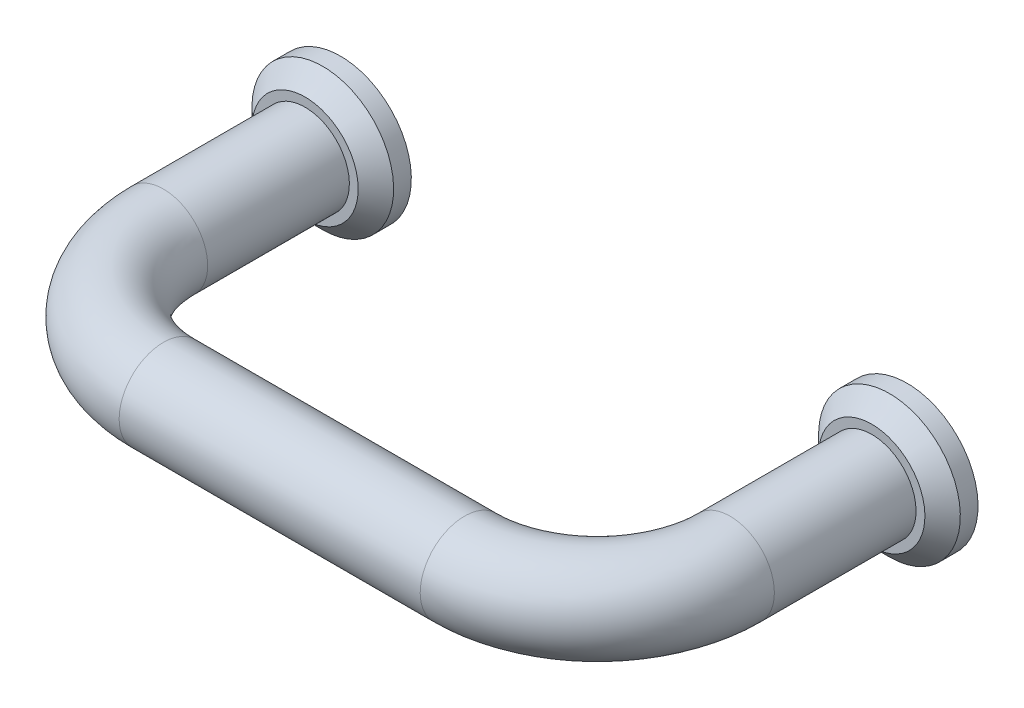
ISO-10303-21;
HEADER;
FILE_DESCRIPTION(('STEP AP214'),'2;1');
FILE_NAME('part.step','',(''),(''),'','','');
FILE_SCHEMA(('AUTOMOTIVE_DESIGN { 1 0 10303 214 1 1 1 1 }'));
ENDSEC;
DATA;
#1=APPLICATION_CONTEXT('core data for automotive mechanical design processes');
#2=APPLICATION_PROTOCOL_DEFINITION('international standard','automotive_design',2000,#1);
#3=PRODUCT_CONTEXT('',#1,'mechanical');
#4=PRODUCT('Part','Part','',(#3));
#5=PRODUCT_RELATED_PRODUCT_CATEGORY('part','',(#4));
#6=PRODUCT_DEFINITION_FORMATION('','',#4);
#7=PRODUCT_DEFINITION_CONTEXT('part definition',#1,'design');
#8=PRODUCT_DEFINITION('design','',#6,#7);
#9=PRODUCT_DEFINITION_SHAPE('','',#8);
#10=(LENGTH_UNIT() NAMED_UNIT(*) SI_UNIT(.MILLI.,.METRE.));
#11=(NAMED_UNIT(*) PLANE_ANGLE_UNIT() SI_UNIT($,.RADIAN.));
#12=(NAMED_UNIT(*) SI_UNIT($,.STERADIAN.) SOLID_ANGLE_UNIT());
#13=UNCERTAINTY_MEASURE_WITH_UNIT(LENGTH_MEASURE(1.E-05),#10,'distance_accuracy_value','');
#14=(GEOMETRIC_REPRESENTATION_CONTEXT(3) GLOBAL_UNCERTAINTY_ASSIGNED_CONTEXT((#13)) GLOBAL_UNIT_ASSIGNED_CONTEXT((#10,
#11,#12)) REPRESENTATION_CONTEXT('',''));
#15=CARTESIAN_POINT('',(0.,0.,0.));
#16=DIRECTION('',(0.,0.,1.));
#17=DIRECTION('',(1.,0.,0.));
#18=AXIS2_PLACEMENT_3D('',#15,#16,#17);
#19=CARTESIAN_POINT('',(0.,0.,0.));
#20=DIRECTION('',(0.,0.,-1.));
#21=DIRECTION('',(0.,1.,0.));
#22=AXIS2_PLACEMENT_3D('',#19,#20,#21);
#23=PLANE('',#22);
#24=CARTESIAN_POINT('',(0.,0.,0.));
#25=DIRECTION('',(0.,0.,1.));
#26=DIRECTION('',(0.,-1.,0.));
#27=AXIS2_PLACEMENT_3D('',#24,#25,#26);
#28=CIRCLE('',#27,4.);
#29=CARTESIAN_POINT('',(0.,-4.,0.));
#30=VERTEX_POINT('',#29);
#31=EDGE_CURVE('E56',#30,#30,#28,.T.);
#32=ORIENTED_EDGE('',*,*,#31,.F.);
#33=EDGE_LOOP('',(#32));
#34=FACE_BOUND('',#33,.T.);
#35=CARTESIAN_POINT('',(0.,0.,0.));
#36=DIRECTION('',(0.,0.,1.));
#37=DIRECTION('',(0.,-1.,0.));
#38=AXIS2_PLACEMENT_3D('',#35,#36,#37);
#39=CIRCLE('',#38,1.5);
#40=CARTESIAN_POINT('',(0.,-1.5,0.));
#41=VERTEX_POINT('',#40);
#42=EDGE_CURVE('E62',#41,#41,#39,.T.);
#43=ORIENTED_EDGE('',*,*,#42,.T.);
#44=EDGE_LOOP('',(#43));
#45=FACE_BOUND('',#44,.T.);
#46=ADVANCED_FACE('F12',(#34,#45),#23,.T.);
#47=CARTESIAN_POINT('',(0.,0.,10.));
#48=DIRECTION('',(0.,0.,-1.));
#49=DIRECTION('',(0.,-1.,0.));
#50=AXIS2_PLACEMENT_3D('',#47,#48,#49);
#51=CYLINDRICAL_SURFACE('',#50,2.5);
#52=CARTESIAN_POINT('',(0.,0.,10.));
#53=DIRECTION('',(0.,0.,-1.));
#54=DIRECTION('',(0.,1.,0.));
#55=AXIS2_PLACEMENT_3D('',#52,#53,#54);
#56=CIRCLE('',#55,2.5);
#57=CARTESIAN_POINT('',(-2.5,0.,10.));
#58=VERTEX_POINT('',#57);
#59=EDGE_CURVE('E20',#58,#58,#56,.T.);
#60=ORIENTED_EDGE('',*,*,#59,.T.);
#61=EDGE_LOOP('',(#60));
#62=FACE_BOUND('',#61,.T.);
#63=CARTESIAN_POINT('',(0.,0.,2.));
#64=DIRECTION('',(0.,0.,-1.));
#65=DIRECTION('',(0.,-1.,0.));
#66=AXIS2_PLACEMENT_3D('',#63,#64,#65);
#67=CIRCLE('',#66,2.5);
#68=CARTESIAN_POINT('',(0.,-2.5,2.));
#69=VERTEX_POINT('',#68);
#70=EDGE_CURVE('E16',#69,#69,#67,.F.);
#71=ORIENTED_EDGE('',*,*,#70,.T.);
#72=EDGE_LOOP('',(#71));
#73=FACE_BOUND('',#72,.T.);
#74=ADVANCED_FACE('F14',(#62,#73),#51,.T.);
#75=CARTESIAN_POINT('',(32.,0.,10.));
#76=DIRECTION('',(0.,0.,-1.));
#77=DIRECTION('',(0.,-1.,0.));
#78=AXIS2_PLACEMENT_3D('',#75,#76,#77);
#79=CYLINDRICAL_SURFACE('',#78,2.5);
#80=CARTESIAN_POINT('',(32.,0.,10.));
#81=DIRECTION('',(0.,0.,1.));
#82=DIRECTION('',(0.,1.,0.));
#83=AXIS2_PLACEMENT_3D('',#80,#81,#82);
#84=CIRCLE('',#83,2.5);
#85=CARTESIAN_POINT('',(34.5,0.,10.));
#86=VERTEX_POINT('',#85);
#87=EDGE_CURVE('E32',#86,#86,#84,.T.);
#88=ORIENTED_EDGE('',*,*,#87,.F.);
#89=EDGE_LOOP('',(#88));
#90=FACE_BOUND('',#89,.T.);
#91=CARTESIAN_POINT('',(32.,0.,2.));
#92=DIRECTION('',(0.,0.,-1.));
#93=DIRECTION('',(0.,-1.,0.));
#94=AXIS2_PLACEMENT_3D('',#91,#92,#93);
#95=CIRCLE('',#94,2.5);
#96=CARTESIAN_POINT('',(32.,-2.5,2.));
#97=VERTEX_POINT('',#96);
#98=EDGE_CURVE('E8',#97,#97,#95,.T.);
#99=ORIENTED_EDGE('',*,*,#98,.F.);
#100=EDGE_LOOP('',(#99));
#101=FACE_BOUND('',#100,.T.);
#102=ADVANCED_FACE('F91',(#90,#101),#79,.T.);
#103=CARTESIAN_POINT('',(7.5,0.,10.));
#104=DIRECTION('',(0.,-1.,0.));
#105=DIRECTION('',(1.,0.,0.));
#106=AXIS2_PLACEMENT_3D('',#103,#104,#105);
#107=TOROIDAL_SURFACE('',#106,7.5,2.5);
#108=CARTESIAN_POINT('',(7.5,0.,17.5));
#109=DIRECTION('',(-1.,0.,0.));
#110=DIRECTION('',(0.,1.,0.));
#111=AXIS2_PLACEMENT_3D('',#108,#109,#110);
#112=CIRCLE('',#111,2.5);
#113=CARTESIAN_POINT('',(7.5,0.,20.));
#114=VERTEX_POINT('',#113);
#115=EDGE_CURVE('E24',#114,#114,#112,.T.);
#116=CARTESIAN_POINT('',(7.5,0.,10.));
#117=DIRECTION('',(0.,-1.,0.));
#118=DIRECTION('',(1.,0.,0.));
#119=AXIS2_PLACEMENT_3D('',#116,#117,#118);
#120=CIRCLE('',#119,10.);
#121=EDGE_CURVE('',#114,#58,#120,.T.);
#122=ORIENTED_EDGE('',*,*,#115,.T.);
#123=ORIENTED_EDGE('',*,*,#59,.F.);
#124=ORIENTED_EDGE('',*,*,#121,.T.);
#125=ORIENTED_EDGE('',*,*,#121,.F.);
#126=EDGE_LOOP('',(#122,#124,#123,#125));
#127=FACE_BOUND('',#126,.T.);
#128=ADVANCED_FACE('F100',(#127),#107,.T.);
#129=CARTESIAN_POINT('',(24.5,0.,17.5));
#130=DIRECTION('',(-1.,0.,0.));
#131=DIRECTION('',(0.,-1.,0.));
#132=AXIS2_PLACEMENT_3D('',#129,#130,#131);
#133=CYLINDRICAL_SURFACE('',#132,2.5);
#134=CARTESIAN_POINT('',(24.5,0.,17.5));
#135=DIRECTION('',(-1.,0.,0.));
#136=DIRECTION('',(0.,1.,0.));
#137=AXIS2_PLACEMENT_3D('',#134,#135,#136);
#138=CIRCLE('',#137,2.5);
#139=CARTESIAN_POINT('',(24.5,0.,20.));
#140=VERTEX_POINT('',#139);
#141=EDGE_CURVE('E29',#140,#140,#138,.T.);
#142=ORIENTED_EDGE('',*,*,#141,.T.);
#143=EDGE_LOOP('',(#142));
#144=FACE_BOUND('',#143,.T.);
#145=ORIENTED_EDGE('',*,*,#115,.F.);
#146=EDGE_LOOP('',(#145));
#147=FACE_BOUND('',#146,.T.);
#148=ADVANCED_FACE('F106',(#144,#147),#133,.T.);
#149=CARTESIAN_POINT('',(24.5,0.,10.));
#150=DIRECTION('',(0.,-1.,0.));
#151=DIRECTION('',(1.,0.,0.));
#152=AXIS2_PLACEMENT_3D('',#149,#150,#151);
#153=TOROIDAL_SURFACE('',#152,7.5,2.5);
#154=CARTESIAN_POINT('',(24.5,0.,10.));
#155=DIRECTION('',(0.,-1.,0.));
#156=DIRECTION('',(1.,0.,0.));
#157=AXIS2_PLACEMENT_3D('',#154,#155,#156);
#158=CIRCLE('',#157,10.);
#159=EDGE_CURVE('',#86,#140,#158,.T.);
#160=ORIENTED_EDGE('',*,*,#87,.T.);
#161=ORIENTED_EDGE('',*,*,#141,.F.);
#162=ORIENTED_EDGE('',*,*,#159,.T.);
#163=ORIENTED_EDGE('',*,*,#159,.F.);
#164=EDGE_LOOP('',(#160,#162,#161,#163));
#165=FACE_BOUND('',#164,.T.);
#166=ADVANCED_FACE('F102',(#165),#153,.T.);
#167=CARTESIAN_POINT('',(32.,0.,2.));
#168=DIRECTION('',(0.,0.,-1.));
#169=DIRECTION('',(0.,-1.,0.));
#170=AXIS2_PLACEMENT_3D('',#167,#168,#169);
#171=PLANE('',#170);
#172=CARTESIAN_POINT('',(32.,0.,2.));
#173=DIRECTION('',(0.,0.,-1.));
#174=DIRECTION('',(0.,-1.,0.));
#175=AXIS2_PLACEMENT_3D('',#172,#173,#174);
#176=CIRCLE('',#175,3.);
#177=CARTESIAN_POINT('',(32.,-3.,2.));
#178=VERTEX_POINT('',#177);
#179=EDGE_CURVE('E35',#178,#178,#176,.T.);
#180=ORIENTED_EDGE('',*,*,#179,.F.);
#181=EDGE_LOOP('',(#180));
#182=FACE_BOUND('',#181,.T.);
#183=ORIENTED_EDGE('',*,*,#98,.T.);
#184=EDGE_LOOP('',(#183));
#185=FACE_BOUND('',#184,.T.);
#186=ADVANCED_FACE('F105',(#182,#185),#171,.F.);
#187=CARTESIAN_POINT('',(32.,0.,2.));
#188=DIRECTION('',(0.,0.,-1.));
#189=DIRECTION('',(0.,-1.,0.));
#190=AXIS2_PLACEMENT_3D('',#187,#188,#189);
#191=CONICAL_SURFACE('',#190,3.,0.785398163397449);
#192=CARTESIAN_POINT('',(32.,0.,1.));
#193=DIRECTION('',(0.,0.,-1.));
#194=DIRECTION('',(0.,-1.,0.));
#195=AXIS2_PLACEMENT_3D('',#192,#193,#194);
#196=CIRCLE('',#195,4.);
#197=CARTESIAN_POINT('',(32.,-4.,1.));
#198=VERTEX_POINT('',#197);
#199=EDGE_CURVE('E38',#198,#198,#196,.T.);
#200=ORIENTED_EDGE('',*,*,#199,.F.);
#201=EDGE_LOOP('',(#200));
#202=FACE_BOUND('',#201,.T.);
#203=ORIENTED_EDGE('',*,*,#179,.T.);
#204=EDGE_LOOP('',(#203));
#205=FACE_BOUND('',#204,.T.);
#206=ADVANCED_FACE('F146',(#202,#205),#191,.T.);
#207=CARTESIAN_POINT('',(32.,0.,0.));
#208=DIRECTION('',(0.,0.,-1.));
#209=DIRECTION('',(0.,-1.,0.));
#210=AXIS2_PLACEMENT_3D('',#207,#208,#209);
#211=CYLINDRICAL_SURFACE('',#210,4.);
#212=CARTESIAN_POINT('',(32.,0.,0.));
#213=DIRECTION('',(0.,0.,-1.));
#214=DIRECTION('',(0.,-1.,0.));
#215=AXIS2_PLACEMENT_3D('',#212,#213,#214);
#216=CIRCLE('',#215,4.);
#217=CARTESIAN_POINT('',(32.,-4.,0.));
#218=VERTEX_POINT('',#217);
#219=EDGE_CURVE('E41',#218,#218,#216,.T.);
#220=ORIENTED_EDGE('',*,*,#219,.F.);
#221=EDGE_LOOP('',(#220));
#222=FACE_BOUND('',#221,.T.);
#223=ORIENTED_EDGE('',*,*,#199,.T.);
#224=EDGE_LOOP('',(#223));
#225=FACE_BOUND('',#224,.T.);
#226=ADVANCED_FACE('F143',(#222,#225),#211,.T.);
#227=CARTESIAN_POINT('',(32.,0.,0.));
#228=DIRECTION('',(0.,0.,1.));
#229=DIRECTION('',(0.,1.,0.));
#230=AXIS2_PLACEMENT_3D('',#227,#228,#229);
#231=PLANE('',#230);
#232=CARTESIAN_POINT('',(32.,0.,0.));
#233=DIRECTION('',(0.,0.,-1.));
#234=DIRECTION('',(0.,-1.,0.));
#235=AXIS2_PLACEMENT_3D('',#232,#233,#234);
#236=CIRCLE('',#235,1.5);
#237=CARTESIAN_POINT('',(32.,-1.5,0.));
#238=VERTEX_POINT('',#237);
#239=EDGE_CURVE('E47',#238,#238,#236,.T.);
#240=ORIENTED_EDGE('',*,*,#239,.F.);
#241=EDGE_LOOP('',(#240));
#242=FACE_BOUND('',#241,.T.);
#243=ORIENTED_EDGE('',*,*,#219,.T.);
#244=EDGE_LOOP('',(#243));
#245=FACE_BOUND('',#244,.T.);
#246=ADVANCED_FACE('F96',(#242,#245),#231,.F.);
#247=CARTESIAN_POINT('',(32.,0.,7.));
#248=DIRECTION('',(0.,0.,-1.));
#249=DIRECTION('',(0.,-1.,0.));
#250=AXIS2_PLACEMENT_3D('',#247,#248,#249);
#251=CYLINDRICAL_SURFACE('',#250,1.5);
#252=CARTESIAN_POINT('',(32.,0.,7.));
#253=DIRECTION('',(0.,0.,-1.));
#254=DIRECTION('',(0.,-1.,0.));
#255=AXIS2_PLACEMENT_3D('',#252,#253,#254);
#256=CIRCLE('',#255,1.5);
#257=CARTESIAN_POINT('',(32.,-1.5,7.));
#258=VERTEX_POINT('',#257);
#259=EDGE_CURVE('E44',#258,#258,#256,.T.);
#260=ORIENTED_EDGE('',*,*,#259,.F.);
#261=EDGE_LOOP('',(#260));
#262=FACE_BOUND('',#261,.T.);
#263=ORIENTED_EDGE('',*,*,#239,.T.);
#264=EDGE_LOOP('',(#263));
#265=FACE_BOUND('',#264,.T.);
#266=ADVANCED_FACE('F127',(#262,#265),#251,.F.);
#267=CARTESIAN_POINT('',(32.,0.,7.));
#268=DIRECTION('',(0.,0.,-1.));
#269=DIRECTION('',(0.,-1.,0.));
#270=AXIS2_PLACEMENT_3D('',#267,#268,#269);
#271=PLANE('',#270);
#272=ORIENTED_EDGE('',*,*,#259,.T.);
#273=EDGE_LOOP('',(#272));
#274=FACE_BOUND('',#273,.T.);
#275=ADVANCED_FACE('F125',(#274),#271,.T.);
#276=CARTESIAN_POINT('',(0.,0.,2.));
#277=DIRECTION('',(0.,0.,-1.));
#278=DIRECTION('',(0.,-1.,0.));
#279=AXIS2_PLACEMENT_3D('',#276,#277,#278);
#280=PLANE('',#279);
#281=ORIENTED_EDGE('',*,*,#70,.F.);
#282=EDGE_LOOP('',(#281));
#283=FACE_BOUND('',#282,.T.);
#284=CARTESIAN_POINT('',(0.,0.,2.));
#285=DIRECTION('',(0.,0.,1.));
#286=DIRECTION('',(0.,-1.,0.));
#287=AXIS2_PLACEMENT_3D('',#284,#285,#286);
#288=CIRCLE('',#287,3.);
#289=CARTESIAN_POINT('',(0.,-3.,2.));
#290=VERTEX_POINT('',#289);
#291=EDGE_CURVE('E50',#290,#290,#288,.T.);
#292=ORIENTED_EDGE('',*,*,#291,.T.);
#293=EDGE_LOOP('',(#292));
#294=FACE_BOUND('',#293,.T.);
#295=ADVANCED_FACE('F122',(#283,#294),#280,.F.);
#296=CARTESIAN_POINT('',(0.,0.,2.));
#297=DIRECTION('',(0.,0.,-1.));
#298=DIRECTION('',(0.,-1.,0.));
#299=AXIS2_PLACEMENT_3D('',#296,#297,#298);
#300=CONICAL_SURFACE('',#299,3.,0.785398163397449);
#301=CARTESIAN_POINT('',(0.,0.,1.));
#302=DIRECTION('',(0.,0.,1.));
#303=DIRECTION('',(0.,-1.,0.));
#304=AXIS2_PLACEMENT_3D('',#301,#302,#303);
#305=CIRCLE('',#304,4.);
#306=CARTESIAN_POINT('',(0.,-4.,1.));
#307=VERTEX_POINT('',#306);
#308=EDGE_CURVE('E53',#307,#307,#305,.T.);
#309=ORIENTED_EDGE('',*,*,#308,.T.);
#310=EDGE_LOOP('',(#309));
#311=FACE_BOUND('',#310,.T.);
#312=ORIENTED_EDGE('',*,*,#291,.F.);
#313=EDGE_LOOP('',(#312));
#314=FACE_BOUND('',#313,.T.);
#315=ADVANCED_FACE('F81',(#311,#314),#300,.T.);
#316=CARTESIAN_POINT('',(0.,0.,0.));
#317=DIRECTION('',(0.,0.,-1.));
#318=DIRECTION('',(0.,-1.,0.));
#319=AXIS2_PLACEMENT_3D('',#316,#317,#318);
#320=CYLINDRICAL_SURFACE('',#319,4.);
#321=ORIENTED_EDGE('',*,*,#31,.T.);
#322=EDGE_LOOP('',(#321));
#323=FACE_BOUND('',#322,.T.);
#324=ORIENTED_EDGE('',*,*,#308,.F.);
#325=EDGE_LOOP('',(#324));
#326=FACE_BOUND('',#325,.T.);
#327=ADVANCED_FACE('F70',(#323,#326),#320,.T.);
#328=CARTESIAN_POINT('',(0.,0.,7.));
#329=DIRECTION('',(0.,0.,-1.));
#330=DIRECTION('',(0.,-1.,0.));
#331=AXIS2_PLACEMENT_3D('',#328,#329,#330);
#332=CYLINDRICAL_SURFACE('',#331,1.5);
#333=CARTESIAN_POINT('',(0.,0.,7.));
#334=DIRECTION('',(0.,0.,1.));
#335=DIRECTION('',(0.,-1.,0.));
#336=AXIS2_PLACEMENT_3D('',#333,#334,#335);
#337=CIRCLE('',#336,1.5);
#338=CARTESIAN_POINT('',(0.,-1.5,7.));
#339=VERTEX_POINT('',#338);
#340=EDGE_CURVE('E59',#339,#339,#337,.T.);
#341=ORIENTED_EDGE('',*,*,#340,.T.);
#342=EDGE_LOOP('',(#341));
#343=FACE_BOUND('',#342,.T.);
#344=ORIENTED_EDGE('',*,*,#42,.F.);
#345=EDGE_LOOP('',(#344));
#346=FACE_BOUND('',#345,.T.);
#347=ADVANCED_FACE('F67',(#343,#346),#332,.F.);
#348=CARTESIAN_POINT('',(0.,0.,7.));
#349=DIRECTION('',(0.,0.,-1.));
#350=DIRECTION('',(0.,-1.,0.));
#351=AXIS2_PLACEMENT_3D('',#348,#349,#350);
#352=PLANE('',#351);
#353=ORIENTED_EDGE('',*,*,#340,.F.);
#354=EDGE_LOOP('',(#353));
#355=FACE_BOUND('',#354,.T.);
#356=ADVANCED_FACE('F69',(#355),#352,.T.);
#357=CLOSED_SHELL('',(#46,#74,#102,#128,#148,#166,#186,#206,#226,#246,#266,#275,#295,#315,#327,
#347,#356));
#358=MANIFOLD_SOLID_BREP('B1',#357);
#359=ADVANCED_BREP_SHAPE_REPRESENTATION('',(#18,#358),#14);
#360=SHAPE_DEFINITION_REPRESENTATION(#9,#359);
ENDSEC;
END-ISO-10303-21;
